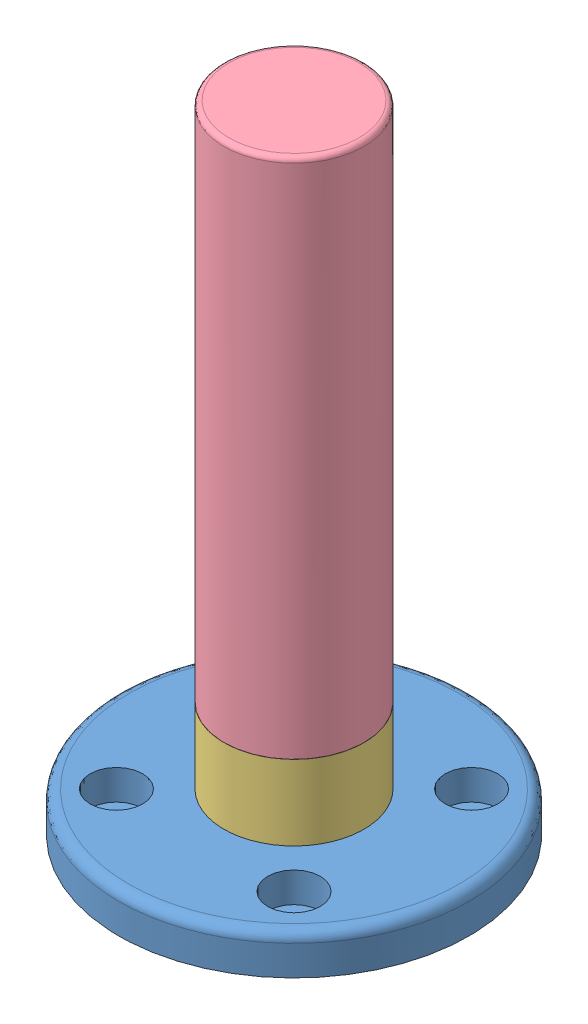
SolidWorks assembly Rotating Cylinder Assembly Pt1.SLDASM, configuration Default (file format 8000). Lengths in mm.
Overall size (70 31 70).
5 component instances, 4 part files, 11 mates.
Components (placement in the parent):
- base_rotation-1: base_rotation.SLDPRT [Default] at (41.2372 28.9916 50.88) size (70 8 70)
- connector-1: connector.SLDPRT [Default] at (37.7372 36.9916 51.13) x (-1 0 0) z (0 0 -1) size (8 28 12)
- connector-2: connector.SLDPRT [Default] at (44.7372 36.9916 51.13) size (8 28 12)
- rotating cylinder 1-1: rotating cylinder 1.SLDPRT [Default] at (41.2372 36.9916 50.88) x (0.999437 0 0.033545) z (-0.033545 0 0.999437) size (28 15 28) (hidden)
- rotating cylinder 2-1: rotating cylinder 2.SLDPRT [Default] at (41.2372 36.1916 50.88) x (0.999437 0 0.033545) z (-0.033545 0 0.999437) size (28 107.2 28) (hidden)
Mates (geometry in assembly coordinates):
- Coincident1: coincident anti-aligned: plane of base_rotation-1 through (37.7372 31.4916 46.63) normal (-1 0 0); plane of connector-1 through (37.7372 36.9916 41.13) normal (1 0 0)
- Coincident2: coincident aligned: plane of base_rotation-1 through (41.2372 36.9916 50.88) normal (0 1 0); plane of connector-1 through (37.7372 36.9916 51.13) normal (0 1 0)
- Coincident3: coincident anti-aligned: line of base_rotation-1 through (29.2372 36.9916 55.13) axis (1 0 0); line of connector-1 through (37.7372 36.9916 55.13) axis (-1 0 0)
- Coincident4: coincident anti-aligned: plane of base_rotation-1 through (44.7372 31.4916 46.63) normal (1 0 0); plane of connector-2 through (44.7372 36.9916 61.13) normal (-1 0 0)
- Coincident5: coincident anti-aligned: line of base_rotation-1 through (44.7372 36.9916 55.13) axis (1 0 0); line of connector-2 through (52.7372 36.9916 55.13) axis (-1 0 0)
- Coincident6: coincident aligned: plane of base_rotation-1 through (41.2372 36.9916 50.88) normal (0 1 0); plane of connector-2 through (44.7372 36.9916 51.13) normal (0 1 0)
- Coincident7: coincident anti-aligned: plane of base_rotation-1 through (41.2372 36.9916 50.88) normal (0 1 0); plane of rotating cylinder 1-1 through (41.2372 36.9916 50.88) normal (0 -1 0)
- Concentric1: concentric aligned: circle of base_rotation-1; circle of rotating cylinder 1-1
- Coincident8: coincident anti-aligned: plane of rotating cylinder 1-1 through (41.2372 51.9916 50.88) normal (0 1 0); plane of rotating cylinder 2-1 through (41.2372 51.9916 50.88) normal (0 -1 0)
- Concentric2: concentric anti-aligned: circle of rotating cylinder 1-1; circle of rotating cylinder 2-1
- Concentric3: concentric anti-aligned: circle of rotating cylinder 1-1; circle of rotating cylinder 2-1
